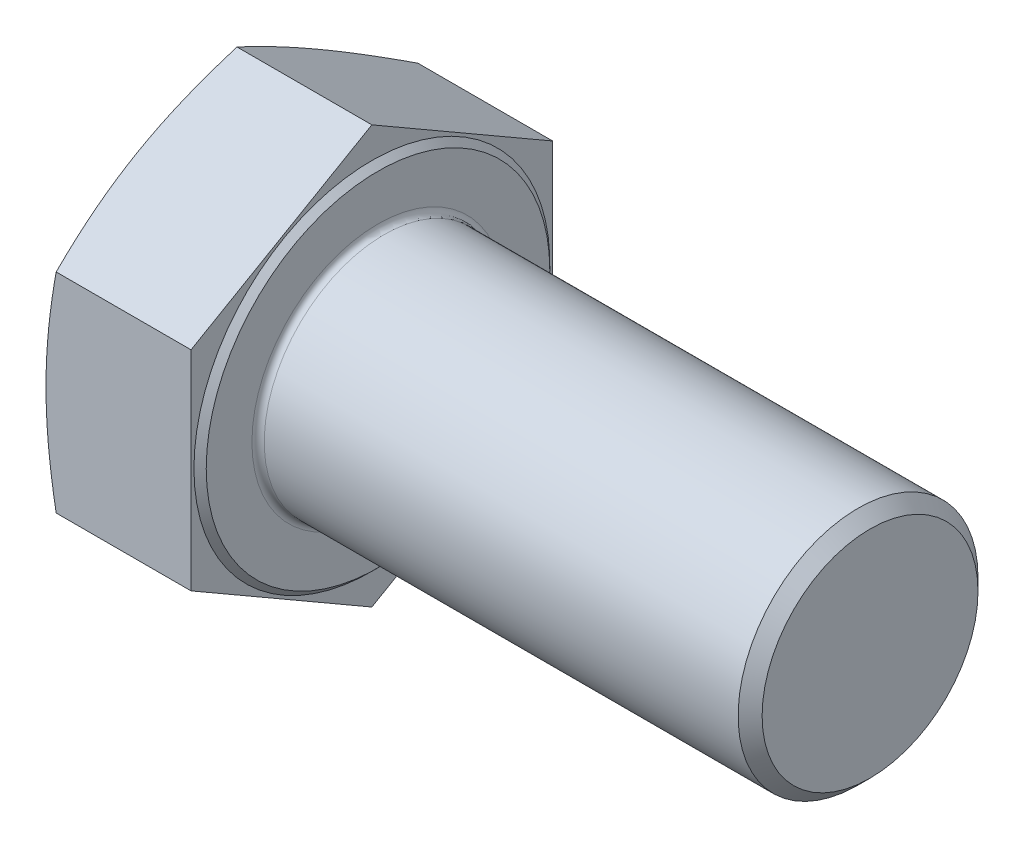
ISO-10303-21;
HEADER;
FILE_DESCRIPTION(('STEP AP214'),'2;1');
FILE_NAME('part.step','',(''),(''),'','','');
FILE_SCHEMA(('AUTOMOTIVE_DESIGN { 1 0 10303 214 1 1 1 1 }'));
ENDSEC;
DATA;
#1=APPLICATION_CONTEXT('core data for automotive mechanical design processes');
#2=APPLICATION_PROTOCOL_DEFINITION('international standard','automotive_design',2000,#1);
#3=PRODUCT_CONTEXT('',#1,'mechanical');
#4=PRODUCT('Part','Part','',(#3));
#5=PRODUCT_RELATED_PRODUCT_CATEGORY('part','',(#4));
#6=PRODUCT_DEFINITION_FORMATION('','',#4);
#7=PRODUCT_DEFINITION_CONTEXT('part definition',#1,'design');
#8=PRODUCT_DEFINITION('design','',#6,#7);
#9=PRODUCT_DEFINITION_SHAPE('','',#8);
#10=(LENGTH_UNIT() NAMED_UNIT(*) SI_UNIT(.MILLI.,.METRE.));
#11=(NAMED_UNIT(*) PLANE_ANGLE_UNIT() SI_UNIT($,.RADIAN.));
#12=(NAMED_UNIT(*) SI_UNIT($,.STERADIAN.) SOLID_ANGLE_UNIT());
#13=UNCERTAINTY_MEASURE_WITH_UNIT(LENGTH_MEASURE(1.E-05),#10,'distance_accuracy_value','');
#14=(GEOMETRIC_REPRESENTATION_CONTEXT(3) GLOBAL_UNCERTAINTY_ASSIGNED_CONTEXT((#13)) GLOBAL_UNIT_ASSIGNED_CONTEXT((#10,
#11,#12)) REPRESENTATION_CONTEXT('',''));
#15=CARTESIAN_POINT('',(0.,0.,0.));
#16=DIRECTION('',(0.,0.,1.));
#17=DIRECTION('',(1.,0.,0.));
#18=AXIS2_PLACEMENT_3D('',#15,#16,#17);
#19=CARTESIAN_POINT('',(24.58,-16.974097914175,-29.4));
#20=DIRECTION('',(1.,0.,0.));
#21=DIRECTION('',(0.,0.,-1.));
#22=AXIS2_PLACEMENT_3D('',#19,#20,#21);
#23=PLANE('',#22);
#24=CARTESIAN_POINT('',(24.58,0.,0.));
#25=DIRECTION('',(1.,0.,0.));
#26=DIRECTION('',(0.,0.,-1.));
#27=AXIS2_PLACEMENT_3D('',#24,#25,#26);
#28=CIRCLE('',#27,20.5);
#29=CARTESIAN_POINT('',(24.58,0.,-20.5));
#30=VERTEX_POINT('',#29);
#31=EDGE_CURVE('E11',#30,#30,#28,.F.);
#32=ORIENTED_EDGE('',*,*,#31,.T.);
#33=EDGE_LOOP('',(#32));
#34=FACE_BOUND('',#33,.T.);
#35=CARTESIAN_POINT('',(24.58,0.,0.));
#36=DIRECTION('',(-1.,0.,0.));
#37=DIRECTION('',(0.,0.,1.));
#38=AXIS2_PLACEMENT_3D('',#35,#36,#37);
#39=CIRCLE('',#38,27.93);
#40=CARTESIAN_POINT('',(24.58,0.,27.93));
#41=VERTEX_POINT('',#40);
#42=EDGE_CURVE('E422',#41,#41,#39,.T.);
#43=ORIENTED_EDGE('',*,*,#42,.F.);
#44=EDGE_LOOP('',(#43));
#45=FACE_BOUND('',#44,.T.);
#46=ADVANCED_FACE('F34',(#34,#45),#23,.T.);
#47=CARTESIAN_POINT('',(24.58,-33.94819582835,0.));
#48=DIRECTION('',(0.,0.866025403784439,0.5));
#49=DIRECTION('',(0.,-0.5,0.866025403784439));
#50=AXIS2_PLACEMENT_3D('',#47,#48,#49);
#51=PLANE('',#50);
#52=CARTESIAN_POINT('',(1.65544992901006,-16.9739824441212,-29.4002));
#53=CARTESIAN_POINT('',(1.5275139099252,-17.3254905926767,-28.7913700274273));
#54=CARTESIAN_POINT('',(1.40533534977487,-17.6775350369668,-28.1816111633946));
#55=CARTESIAN_POINT('',(1.17375096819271,-18.3827051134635,-26.9602207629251));
#56=CARTESIAN_POINT('',(1.06434636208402,-18.7358308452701,-26.3485890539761));
#57=CARTESIAN_POINT('',(0.859514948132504,-19.4433731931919,-25.1230897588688));
#58=CARTESIAN_POINT('',(0.764098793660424,-19.7977905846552,-24.5092208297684));
#59=CARTESIAN_POINT('',(0.588608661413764,-20.5075718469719,-23.2798436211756));
#60=CARTESIAN_POINT('',(0.508534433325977,-20.8629357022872,-22.6643353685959));
#61=CARTESIAN_POINT('',(0.365585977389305,-21.5711444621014,-21.4376818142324));
#62=CARTESIAN_POINT('',(0.302556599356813,-21.9239814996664,-20.8265501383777));
#63=CARTESIAN_POINT('',(0.193711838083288,-22.6303241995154,-19.6031286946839));
#64=CARTESIAN_POINT('',(0.147896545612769,-22.9838298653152,-18.9908389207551));
#65=CARTESIAN_POINT('',(0.0742768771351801,-23.6911828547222,-17.7656676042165));
#66=CARTESIAN_POINT('',(0.0464659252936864,-24.0450300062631,-17.1527863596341));
#67=CARTESIAN_POINT('',(0.00932751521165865,-24.7529670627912,-15.9266034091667));
#68=CARTESIAN_POINT('',(0.,-25.1070569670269,-15.3133017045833));
#69=CARTESIAN_POINT('',(0.,-25.8152367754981,-14.0866982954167));
#70=CARTESIAN_POINT('',(0.00932751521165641,-26.1693266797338,-13.4733965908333));
#71=CARTESIAN_POINT('',(0.046465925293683,-26.8772637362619,-12.2472136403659));
#72=CARTESIAN_POINT('',(0.0742768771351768,-27.2311108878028,-11.6343323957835));
#73=CARTESIAN_POINT('',(0.147896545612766,-27.9384638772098,-10.4091610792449));
#74=CARTESIAN_POINT('',(0.193711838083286,-28.2919695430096,-9.79687130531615));
#75=CARTESIAN_POINT('',(0.30255659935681,-28.9983122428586,-8.57344986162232));
#76=CARTESIAN_POINT('',(0.3655859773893,-29.3511492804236,-7.96231818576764));
#77=CARTESIAN_POINT('',(0.508534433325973,-30.0593580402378,-6.73566463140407));
#78=CARTESIAN_POINT('',(0.588608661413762,-30.4147218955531,-6.1201563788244));
#79=CARTESIAN_POINT('',(0.764098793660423,-31.1245031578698,-4.89077917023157));
#80=CARTESIAN_POINT('',(0.859514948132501,-31.4789205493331,-4.27691024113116));
#81=CARTESIAN_POINT('',(1.06434636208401,-32.1864628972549,-3.05141094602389));
#82=CARTESIAN_POINT('',(1.1737509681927,-32.5395886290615,-2.43977923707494));
#83=CARTESIAN_POINT('',(1.40533534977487,-33.2447587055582,-1.21838883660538));
#84=CARTESIAN_POINT('',(1.5275139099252,-33.5968031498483,-0.608629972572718));
#85=CARTESIAN_POINT('',(1.65544992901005,-33.9483112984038,0.000200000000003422));
#86=B_SPLINE_CURVE_WITH_KNOTS('',3,(#52,#53,#54,#55,#56,#57,#58,#59,#60,#61,#62,#63,#64,#65,#66,
#67,#68,#69,#70,#71,#72,#73,#74,#75,#76,#77,#78,#79,#80,#81,#82,#83,#84,#85),.UNSPECIFIED.,.F.,
.F.,(4,2,2,2,2,2,2,2,2,2,2,2,2,2,2,2,4),(0.,2.14369982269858,4.28760343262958,6.433131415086,
8.57862438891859,10.7038751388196,12.8291370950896,14.9536223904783,17.0781011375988,
19.2025798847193,21.3270651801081,23.4523271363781,25.5775778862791,27.7230708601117,
29.8685988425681,32.0125024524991,34.1562022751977),.UNSPECIFIED.);
#87=CARTESIAN_POINT('',(1.65540790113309,-16.974097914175,-29.4));
#88=VERTEX_POINT('',#87);
#89=CARTESIAN_POINT('',(0.,-25.4611468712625,-14.7));
#90=VERTEX_POINT('',#89);
#91=EDGE_CURVE('E113',#88,#90,#86,.T.);
#92=ORIENTED_EDGE('',*,*,#91,.F.);
#93=DIRECTION('',(-1.,0.,0.));
#94=VECTOR('',#93,1.);
#95=CARTESIAN_POINT('',(24.58,-16.974097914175,-29.4));
#96=LINE('',#95,#94);
#97=CARTESIAN_POINT('',(23.58,-16.974097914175,-29.4));
#98=VERTEX_POINT('',#97);
#99=EDGE_CURVE('E142',#98,#88,#96,.T.);
#100=ORIENTED_EDGE('',*,*,#99,.F.);
#101=DIRECTION('',(0.,0.5,-0.866025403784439));
#102=VECTOR('',#101,1.);
#103=CARTESIAN_POINT('',(23.58,-33.94819582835,0.));
#104=LINE('',#103,#102);
#105=CARTESIAN_POINT('',(23.58,-33.94819582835,0.));
#106=VERTEX_POINT('',#105);
#107=EDGE_CURVE('E427',#106,#98,#104,.T.);
#108=ORIENTED_EDGE('',*,*,#107,.F.);
#109=DIRECTION('',(-1.,0.,0.));
#110=VECTOR('',#109,1.);
#111=CARTESIAN_POINT('',(24.58,-33.94819582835,0.));
#112=LINE('',#111,#110);
#113=CARTESIAN_POINT('',(1.65540790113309,-33.94819582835,0.));
#114=VERTEX_POINT('',#113);
#115=EDGE_CURVE('E136',#106,#114,#112,.T.);
#116=ORIENTED_EDGE('',*,*,#115,.T.);
#117=EDGE_CURVE('E222',#90,#114,#86,.T.);
#118=ORIENTED_EDGE('',*,*,#117,.F.);
#119=EDGE_LOOP('',(#92,#100,#108,#116,#118));
#120=FACE_BOUND('',#119,.T.);
#121=ADVANCED_FACE('F36',(#120),#51,.F.);
#122=CARTESIAN_POINT('',(24.58,-16.974097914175,-29.4));
#123=DIRECTION('',(0.,0.,1.));
#124=DIRECTION('',(0.,-1.,0.));
#125=AXIS2_PLACEMENT_3D('',#122,#123,#124);
#126=PLANE('',#125);
#127=CARTESIAN_POINT('',(8.84584491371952,-44.9414479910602,-29.4));
#128=CARTESIAN_POINT('',(8.64327840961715,-44.2763764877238,-29.4));
#129=CARTESIAN_POINT('',(8.44193693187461,-43.6109320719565,-29.4));
#130=CARTESIAN_POINT('',(8.04197827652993,-42.2792210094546,-29.4));
#131=CARTESIAN_POINT('',(7.8433611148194,-41.6129543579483,-29.4));
#132=CARTESIAN_POINT('',(7.25198186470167,-39.6127195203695,-29.4));
#133=CARTESIAN_POINT('',(6.86372203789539,-38.2774147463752,-29.4));
#134=CARTESIAN_POINT('',(6.10126336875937,-35.6000928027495,-29.4));
#135=CARTESIAN_POINT('',(5.72709211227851,-34.2580677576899,-29.4));
#136=CARTESIAN_POINT('',(4.99715904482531,-31.5690262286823,-29.4));
#137=CARTESIAN_POINT('',(4.64139690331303,-30.2220098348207,-29.4));
#138=CARTESIAN_POINT('',(3.95709637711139,-27.5387320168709,-29.4));
#139=CARTESIAN_POINT('',(3.62827641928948,-26.2025427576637,-29.4));
#140=CARTESIAN_POINT('',(2.99863098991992,-23.5235161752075,-29.4));
#141=CARTESIAN_POINT('',(2.69780598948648,-22.1806787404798,-29.4));
#142=CARTESIAN_POINT('',(2.13116522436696,-19.4880508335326,-29.4));
#143=CARTESIAN_POINT('',(1.86533751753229,-18.1382628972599,-29.4));
#144=CARTESIAN_POINT('',(1.37678298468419,-15.4308636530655,-29.4));
#145=CARTESIAN_POINT('',(1.15405471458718,-14.0732526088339,-29.4));
#146=CARTESIAN_POINT('',(0.782809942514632,-11.5030206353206,-29.4));
#147=CARTESIAN_POINT('',(0.628772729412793,-10.2912096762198,-29.4));
#148=CARTESIAN_POINT('',(0.433189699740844,-8.46971553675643,-29.4));
#149=CARTESIAN_POINT('',(0.373906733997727,-7.86191013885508,-29.4));
#150=CARTESIAN_POINT('',(0.267832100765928,-6.64521595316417,-29.4));
#151=CARTESIAN_POINT('',(0.221040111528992,-6.03632719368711,-29.4));
#152=CARTESIAN_POINT('',(0.140552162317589,-4.8181027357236,-29.4));
#153=CARTESIAN_POINT('',(0.106847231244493,-4.20876763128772,-29.4));
#154=CARTESIAN_POINT('',(0.0529231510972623,-2.98949852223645,-29.4));
#155=CARTESIAN_POINT('',(0.0327039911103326,-2.3795645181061,-29.4));
#156=CARTESIAN_POINT('',(0.00602332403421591,-1.15939670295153,-29.4));
#157=CARTESIAN_POINT('',(-0.000438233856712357,-0.549162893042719,-29.4));
#158=CARTESIAN_POINT('',(0.000484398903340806,0.671294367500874,-29.4));
#159=CARTESIAN_POINT('',(0.00786859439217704,1.28151781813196,-29.4));
#160=CARTESIAN_POINT('',(0.0364542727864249,2.50473436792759,-29.4));
#161=CARTESIAN_POINT('',(0.0577255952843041,3.11772582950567,-29.4));
#162=CARTESIAN_POINT('',(0.113864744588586,4.34308303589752,-29.4));
#163=CARTESIAN_POINT('',(0.148732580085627,4.95544878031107,-29.4));
#164=CARTESIAN_POINT('',(0.231611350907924,6.17928932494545,-29.4));
#165=CARTESIAN_POINT('',(0.27962230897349,6.79076412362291,-29.4));
#166=CARTESIAN_POINT('',(0.388192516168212,8.01260431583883,-29.4));
#167=CARTESIAN_POINT('',(0.448752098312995,8.62296967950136,-29.4));
#168=CARTESIAN_POINT('',(0.648336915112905,10.4531228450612,-29.4));
#169=CARTESIAN_POINT('',(0.805200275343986,11.6709945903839,-29.4));
#170=CARTESIAN_POINT('',(1.16016895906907,14.1006040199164,-29.4));
#171=CARTESIAN_POINT('',(1.35827450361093,15.3123416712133,-29.4));
#172=CARTESIAN_POINT('',(1.80067196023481,17.7934990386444,-29.4));
#173=CARTESIAN_POINT('',(2.0468526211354,19.0625795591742,-29.4));
#174=CARTESIAN_POINT('',(2.57089937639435,21.594220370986,-29.4));
#175=CARTESIAN_POINT('',(2.84876785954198,22.856780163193,-29.4));
#176=CARTESIAN_POINT('',(3.4303549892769,25.3762832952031,-29.4));
#177=CARTESIAN_POINT('',(3.73408114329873,26.6332248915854,-29.4));
#178=CARTESIAN_POINT('',(4.36244304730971,29.1418129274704,-29.4));
#179=CARTESIAN_POINT('',(4.68707829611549,30.3934594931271,-29.4));
#180=CARTESIAN_POINT('',(5.35377779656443,32.8938074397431,-29.4));
#181=CARTESIAN_POINT('',(5.69586389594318,34.1425029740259,-29.4));
#182=CARTESIAN_POINT('',(6.39395180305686,36.6359928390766,-29.4));
#183=CARTESIAN_POINT('',(6.74995366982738,37.88078715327,-29.4));
#184=CARTESIAN_POINT('',(7.47332607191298,40.3668343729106,-29.4));
#185=CARTESIAN_POINT('',(7.84069468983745,41.6080878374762,-29.4));
#186=CARTESIAN_POINT('',(8.58488250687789,44.0877508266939,-29.4));
#187=CARTESIAN_POINT('',(8.96170168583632,45.3261603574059,-29.4));
#188=CARTESIAN_POINT('',(9.71901271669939,47.7868927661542,-29.4));
#189=CARTESIAN_POINT('',(10.0994180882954,49.009242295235,-29.4));
#190=CARTESIAN_POINT('',(10.8667087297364,51.4519039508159,-29.4));
#191=CARTESIAN_POINT('',(11.2535940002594,52.6722160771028,-29.4));
#192=CARTESIAN_POINT('',(12.032871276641,55.1111409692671,-29.4));
#193=CARTESIAN_POINT('',(12.4252635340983,56.3297536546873,-29.4));
#194=CARTESIAN_POINT('',(13.2147302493,58.7654616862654,-29.4));
#195=CARTESIAN_POINT('',(13.6118047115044,59.9825570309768,-29.4));
#196=CARTESIAN_POINT('',(14.4084575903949,62.4108110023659,-29.4));
#197=CARTESIAN_POINT('',(14.8080207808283,63.6219746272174,-29.4));
#198=CARTESIAN_POINT('',(15.610595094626,66.0431592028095,-29.4));
#199=CARTESIAN_POINT('',(16.013606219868,67.2531801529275,-29.4));
#200=CARTESIAN_POINT('',(16.8225888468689,69.6721214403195,-29.4));
#201=CARTESIAN_POINT('',(17.2285601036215,70.8810418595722,-29.4));
#202=CARTESIAN_POINT('',(18.0431295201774,73.2979942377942,-29.4));
#203=CARTESIAN_POINT('',(18.4517276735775,74.506026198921,-29.4));
#204=CARTESIAN_POINT('',(18.8614572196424,75.7136733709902,-29.4));
#205=B_SPLINE_CURVE_WITH_KNOTS('',3,(#127,#128,#129,#130,#131,#132,#133,#134,#135,#136,#137,
#138,#139,#140,#141,#142,#143,#144,#145,#146,#147,#148,#149,#150,#151,#152,#153,#154,#155,#156,
#157,#158,#159,#160,#161,#162,#163,#164,#165,#166,#167,#168,#169,#170,#171,#172,#173,#174,#175,
#176,#177,#178,#179,#180,#181,#182,#183,#184,#185,#186,#187,#188,#189,#190,#191,#192,#193,#194,
#195,#196,#197,#198,#199,#200,#201,#202,#203,#204),.UNSPECIFIED.,.F.,.F.,(4,2,2,2,2,2,2,2,2,2,2,
2,2,2,2,2,2,2,2,2,2,2,2,2,2,2,2,2,2,2,2,2,2,2,2,2,2,2,4),(0.,2.08570621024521,4.17142458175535,
8.34316965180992,12.5226981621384,16.7021516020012,20.8300745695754,24.9580669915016,
29.0846471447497,33.2110890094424,36.8748774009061,38.7068381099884,40.5387516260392,
42.3694071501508,44.2000611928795,46.0307084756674,47.8613563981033,49.7012824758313,
51.5412097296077,53.3811401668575,55.2211194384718,58.9040023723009,62.5869050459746,
66.4646143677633,70.3426162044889,74.2217478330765,78.1007865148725,81.9848068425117,
85.8688436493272,89.752228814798,93.6356056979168,97.4761079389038,101.316610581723,
105.157289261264,108.997971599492,112.824075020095,116.650180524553,120.475972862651,
124.301755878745),.UNSPECIFIED.);
#206=CARTESIAN_POINT('',(1.65540790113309,16.974097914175,-29.4));
#207=VERTEX_POINT('',#206);
#208=CARTESIAN_POINT('',(0.,0.,-29.4));
#209=VERTEX_POINT('',#208);
#210=EDGE_CURVE('E233',#207,#209,#205,.F.);
#211=ORIENTED_EDGE('',*,*,#210,.F.);
#212=DIRECTION('',(-1.,0.,0.));
#213=VECTOR('',#212,1.);
#214=CARTESIAN_POINT('',(24.58,16.974097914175,-29.4));
#215=LINE('',#214,#213);
#216=CARTESIAN_POINT('',(23.58,16.974097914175,-29.4));
#217=VERTEX_POINT('',#216);
#218=EDGE_CURVE('E133',#217,#207,#215,.T.);
#219=ORIENTED_EDGE('',*,*,#218,.F.);
#220=DIRECTION('',(0.,1.,0.));
#221=VECTOR('',#220,1.);
#222=CARTESIAN_POINT('',(23.58,-16.974097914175,-29.4));
#223=LINE('',#222,#221);
#224=EDGE_CURVE('E420',#98,#217,#223,.T.);
#225=ORIENTED_EDGE('',*,*,#224,.F.);
#226=ORIENTED_EDGE('',*,*,#99,.T.);
#227=EDGE_CURVE('E124',#209,#88,#205,.F.);
#228=ORIENTED_EDGE('',*,*,#227,.F.);
#229=EDGE_LOOP('',(#211,#219,#225,#226,#228));
#230=FACE_BOUND('',#229,.T.);
#231=ADVANCED_FACE('F181',(#230),#126,.F.);
#232=CARTESIAN_POINT('',(24.58,16.974097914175,-29.4));
#233=DIRECTION('',(0.,-0.866025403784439,0.5));
#234=DIRECTION('',(0.,-0.5,-0.866025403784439));
#235=AXIS2_PLACEMENT_3D('',#232,#233,#234);
#236=PLANE('',#235);
#237=CARTESIAN_POINT('',(1.65544992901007,33.9483112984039,0.000199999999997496));
#238=CARTESIAN_POINT('',(1.52751390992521,33.5968031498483,-0.60862997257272));
#239=CARTESIAN_POINT('',(1.40533534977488,33.2447587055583,-1.21838883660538));
#240=CARTESIAN_POINT('',(1.17375096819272,32.5395886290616,-2.43977923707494));
#241=CARTESIAN_POINT('',(1.06434636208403,32.186462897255,-3.0514109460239));
#242=CARTESIAN_POINT('',(0.859514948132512,31.4789205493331,-4.27691024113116));
#243=CARTESIAN_POINT('',(0.764098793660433,31.1245031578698,-4.89077917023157));
#244=CARTESIAN_POINT('',(0.588608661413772,30.4147218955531,-6.12015637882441));
#245=CARTESIAN_POINT('',(0.508534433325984,30.0593580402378,-6.73566463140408));
#246=CARTESIAN_POINT('',(0.365585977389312,29.3511492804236,-7.96231818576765));
#247=CARTESIAN_POINT('',(0.302556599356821,28.9983122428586,-8.57344986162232));
#248=CARTESIAN_POINT('',(0.193711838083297,28.2919695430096,-9.79687130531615));
#249=CARTESIAN_POINT('',(0.147896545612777,27.9384638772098,-10.4091610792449));
#250=CARTESIAN_POINT('',(0.0742768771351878,27.2311108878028,-11.6343323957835));
#251=CARTESIAN_POINT('',(0.0464659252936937,26.8772637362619,-12.2472136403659));
#252=CARTESIAN_POINT('',(0.00932751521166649,26.1693266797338,-13.4733965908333));
#253=CARTESIAN_POINT('',(0.,25.8152367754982,-14.0866982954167));
#254=CARTESIAN_POINT('',(0.,25.1070569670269,-15.3133017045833));
#255=CARTESIAN_POINT('',(0.00932751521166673,24.7529670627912,-15.9266034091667));
#256=CARTESIAN_POINT('',(0.0464659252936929,24.0450300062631,-17.1527863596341));
#257=CARTESIAN_POINT('',(0.0742768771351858,23.6911828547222,-17.7656676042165));
#258=CARTESIAN_POINT('',(0.147896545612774,22.9838298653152,-18.9908389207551));
#259=CARTESIAN_POINT('',(0.193711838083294,22.6303241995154,-19.6031286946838));
#260=CARTESIAN_POINT('',(0.302556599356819,21.9239814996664,-20.8265501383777));
#261=CARTESIAN_POINT('',(0.36558597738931,21.5711444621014,-21.4376818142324));
#262=CARTESIAN_POINT('',(0.508534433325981,20.8629357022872,-22.6643353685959));
#263=CARTESIAN_POINT('',(0.588608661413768,20.5075718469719,-23.2798436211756));
#264=CARTESIAN_POINT('',(0.764098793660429,19.7977905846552,-24.5092208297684));
#265=CARTESIAN_POINT('',(0.859514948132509,19.443373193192,-25.1230897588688));
#266=CARTESIAN_POINT('',(1.06434636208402,18.7358308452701,-26.3485890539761));
#267=CARTESIAN_POINT('',(1.17375096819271,18.3827051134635,-26.9602207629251));
#268=CARTESIAN_POINT('',(1.40533534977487,17.6775350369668,-28.1816111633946));
#269=CARTESIAN_POINT('',(1.5275139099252,17.3254905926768,-28.7913700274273));
#270=CARTESIAN_POINT('',(1.65544992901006,16.9739824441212,-29.4002));
#271=B_SPLINE_CURVE_WITH_KNOTS('',3,(#237,#238,#239,#240,#241,#242,#243,#244,#245,#246,#247,
#248,#249,#250,#251,#252,#253,#254,#255,#256,#257,#258,#259,#260,#261,#262,#263,#264,#265,#266,
#267,#268,#269,#270),.UNSPECIFIED.,.F.,.F.,(4,2,2,2,2,2,2,2,2,2,2,2,2,2,2,2,4),(0.,
2.14369982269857,4.28760343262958,6.433131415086,8.57862438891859,10.7038751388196,
12.8291370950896,14.9536223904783,17.0781011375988,19.2025798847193,21.3270651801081,
23.4523271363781,25.5775778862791,27.7230708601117,29.8685988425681,32.0125024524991,
34.1562022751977),.UNSPECIFIED.);
#272=CARTESIAN_POINT('',(1.65540790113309,33.94819582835,0.));
#273=VERTEX_POINT('',#272);
#274=CARTESIAN_POINT('',(0.,25.4611468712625,-14.7));
#275=VERTEX_POINT('',#274);
#276=EDGE_CURVE('E50',#273,#275,#271,.T.);
#277=ORIENTED_EDGE('',*,*,#276,.F.);
#278=DIRECTION('',(-1.,0.,0.));
#279=VECTOR('',#278,1.);
#280=CARTESIAN_POINT('',(24.58,33.94819582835,0.));
#281=LINE('',#280,#279);
#282=CARTESIAN_POINT('',(23.58,33.94819582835,0.));
#283=VERTEX_POINT('',#282);
#284=EDGE_CURVE('E130',#283,#273,#281,.T.);
#285=ORIENTED_EDGE('',*,*,#284,.F.);
#286=DIRECTION('',(0.,0.5,0.866025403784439));
#287=VECTOR('',#286,1.);
#288=CARTESIAN_POINT('',(23.58,16.974097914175,-29.4));
#289=LINE('',#288,#287);
#290=EDGE_CURVE('E418',#217,#283,#289,.T.);
#291=ORIENTED_EDGE('',*,*,#290,.F.);
#292=ORIENTED_EDGE('',*,*,#218,.T.);
#293=EDGE_CURVE('E234',#275,#207,#271,.T.);
#294=ORIENTED_EDGE('',*,*,#293,.F.);
#295=EDGE_LOOP('',(#277,#285,#291,#292,#294));
#296=FACE_BOUND('',#295,.T.);
#297=ADVANCED_FACE('F242',(#296),#236,.F.);
#298=CARTESIAN_POINT('',(24.58,33.94819582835,0.));
#299=DIRECTION('',(0.,-0.866025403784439,-0.5));
#300=DIRECTION('',(0.,0.5,-0.866025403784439));
#301=AXIS2_PLACEMENT_3D('',#298,#299,#300);
#302=PLANE('',#301);
#303=CARTESIAN_POINT('',(1.65544992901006,16.9739824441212,29.4002));
#304=CARTESIAN_POINT('',(1.52751390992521,17.3254905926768,28.7913700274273));
#305=CARTESIAN_POINT('',(1.40533534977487,17.6775350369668,28.1816111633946));
#306=CARTESIAN_POINT('',(1.17375096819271,18.3827051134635,26.9602207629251));
#307=CARTESIAN_POINT('',(1.06434636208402,18.7358308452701,26.3485890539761));
#308=CARTESIAN_POINT('',(0.859514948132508,19.443373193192,25.1230897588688));
#309=CARTESIAN_POINT('',(0.764098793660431,19.7977905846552,24.5092208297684));
#310=CARTESIAN_POINT('',(0.588608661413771,20.5075718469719,23.2798436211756));
#311=CARTESIAN_POINT('',(0.508534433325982,20.8629357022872,22.6643353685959));
#312=CARTESIAN_POINT('',(0.365585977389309,21.5711444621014,21.4376818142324));
#313=CARTESIAN_POINT('',(0.302556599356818,21.9239814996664,20.8265501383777));
#314=CARTESIAN_POINT('',(0.193711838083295,22.6303241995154,19.6031286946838));
#315=CARTESIAN_POINT('',(0.147896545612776,22.9838298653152,18.9908389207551));
#316=CARTESIAN_POINT('',(0.0742768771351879,23.6911828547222,17.7656676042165));
#317=CARTESIAN_POINT('',(0.0464659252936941,24.0450300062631,17.1527863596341));
#318=CARTESIAN_POINT('',(0.00932751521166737,24.7529670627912,15.9266034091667));
#319=CARTESIAN_POINT('',(0.,25.1070569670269,15.3133017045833));
#320=CARTESIAN_POINT('',(0.,25.8152367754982,14.0866982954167));
#321=CARTESIAN_POINT('',(0.00932751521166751,26.1693266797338,13.4733965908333));
#322=CARTESIAN_POINT('',(0.046465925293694,26.8772637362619,12.2472136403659));
#323=CARTESIAN_POINT('',(0.0742768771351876,27.2311108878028,11.6343323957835));
#324=CARTESIAN_POINT('',(0.147896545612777,27.9384638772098,10.4091610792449));
#325=CARTESIAN_POINT('',(0.193711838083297,28.2919695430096,9.79687130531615));
#326=CARTESIAN_POINT('',(0.302556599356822,28.9983122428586,8.57344986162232));
#327=CARTESIAN_POINT('',(0.365585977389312,29.3511492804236,7.96231818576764));
#328=CARTESIAN_POINT('',(0.508534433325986,30.0593580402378,6.73566463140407));
#329=CARTESIAN_POINT('',(0.588608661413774,30.4147218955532,6.1201563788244));
#330=CARTESIAN_POINT('',(0.764098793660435,31.1245031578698,4.89077917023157));
#331=CARTESIAN_POINT('',(0.859514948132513,31.4789205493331,4.27691024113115));
#332=CARTESIAN_POINT('',(1.06434636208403,32.186462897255,3.05141094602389));
#333=CARTESIAN_POINT('',(1.17375096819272,32.5395886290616,2.43977923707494));
#334=CARTESIAN_POINT('',(1.40533534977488,33.2447587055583,1.21838883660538));
#335=CARTESIAN_POINT('',(1.52751390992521,33.5968031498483,0.608629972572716));
#336=CARTESIAN_POINT('',(1.65544992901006,33.9483112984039,-0.000200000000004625));
#337=B_SPLINE_CURVE_WITH_KNOTS('',3,(#303,#304,#305,#306,#307,#308,#309,#310,#311,#312,#313,
#314,#315,#316,#317,#318,#319,#320,#321,#322,#323,#324,#325,#326,#327,#328,#329,#330,#331,#332,
#333,#334,#335,#336),.UNSPECIFIED.,.F.,.F.,(4,2,2,2,2,2,2,2,2,2,2,2,2,2,2,2,4),(0.,
2.14369982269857,4.28760343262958,6.433131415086,8.57862438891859,10.7038751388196,
12.8291370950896,14.9536223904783,17.0781011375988,19.2025798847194,21.3270651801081,
23.4523271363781,25.5775778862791,27.7230708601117,29.8685988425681,32.0125024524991,
34.1562022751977),.UNSPECIFIED.);
#338=CARTESIAN_POINT('',(1.65540790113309,16.9740979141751,29.4));
#339=VERTEX_POINT('',#338);
#340=CARTESIAN_POINT('',(0.,25.4611468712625,14.7));
#341=VERTEX_POINT('',#340);
#342=EDGE_CURVE('E58',#339,#341,#337,.T.);
#343=ORIENTED_EDGE('',*,*,#342,.F.);
#344=DIRECTION('',(-1.,0.,0.));
#345=VECTOR('',#344,1.);
#346=CARTESIAN_POINT('',(24.58,16.974097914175,29.4));
#347=LINE('',#346,#345);
#348=CARTESIAN_POINT('',(23.58,16.9740979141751,29.4));
#349=VERTEX_POINT('',#348);
#350=EDGE_CURVE('E121',#349,#339,#347,.T.);
#351=ORIENTED_EDGE('',*,*,#350,.F.);
#352=DIRECTION('',(0.,-0.5,0.866025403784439));
#353=VECTOR('',#352,1.);
#354=CARTESIAN_POINT('',(23.58,33.94819582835,0.));
#355=LINE('',#354,#353);
#356=EDGE_CURVE('E416',#283,#349,#355,.T.);
#357=ORIENTED_EDGE('',*,*,#356,.F.);
#358=ORIENTED_EDGE('',*,*,#284,.T.);
#359=EDGE_CURVE('E123',#341,#273,#337,.T.);
#360=ORIENTED_EDGE('',*,*,#359,.F.);
#361=EDGE_LOOP('',(#343,#351,#357,#358,#360));
#362=FACE_BOUND('',#361,.T.);
#363=ADVANCED_FACE('F119',(#362),#302,.F.);
#364=CARTESIAN_POINT('',(24.58,16.974097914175,29.4));
#365=DIRECTION('',(0.,0.,-1.));
#366=DIRECTION('',(0.,1.,0.));
#367=AXIS2_PLACEMENT_3D('',#364,#365,#366);
#368=PLANE('',#367);
#369=CARTESIAN_POINT('',(8.84584491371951,-44.9414479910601,29.4));
#370=CARTESIAN_POINT('',(8.64327840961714,-44.2763764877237,29.4));
#371=CARTESIAN_POINT('',(8.4419369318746,-43.6109320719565,29.4));
#372=CARTESIAN_POINT('',(8.04197827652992,-42.2792210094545,29.4));
#373=CARTESIAN_POINT('',(7.84336111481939,-41.6129543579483,29.4));
#374=CARTESIAN_POINT('',(7.25198186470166,-39.6127195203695,29.4));
#375=CARTESIAN_POINT('',(6.86372203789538,-38.2774147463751,29.4));
#376=CARTESIAN_POINT('',(6.10126336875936,-35.6000928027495,29.4));
#377=CARTESIAN_POINT('',(5.7270921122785,-34.2580677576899,29.4));
#378=CARTESIAN_POINT('',(4.9971590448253,-31.5690262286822,29.4));
#379=CARTESIAN_POINT('',(4.64139690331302,-30.2220098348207,29.4));
#380=CARTESIAN_POINT('',(3.95709637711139,-27.5387320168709,29.4));
#381=CARTESIAN_POINT('',(3.62827641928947,-26.2025427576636,29.4));
#382=CARTESIAN_POINT('',(2.99863098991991,-23.5235161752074,29.4));
#383=CARTESIAN_POINT('',(2.69780598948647,-22.1806787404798,29.4));
#384=CARTESIAN_POINT('',(2.13116522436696,-19.4880508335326,29.4));
#385=CARTESIAN_POINT('',(1.86533751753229,-18.1382628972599,29.4));
#386=CARTESIAN_POINT('',(1.37678298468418,-15.4308636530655,29.4));
#387=CARTESIAN_POINT('',(1.15405471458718,-14.0732526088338,29.4));
#388=CARTESIAN_POINT('',(0.782809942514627,-11.5030206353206,29.4));
#389=CARTESIAN_POINT('',(0.62877272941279,-10.2912096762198,29.4));
#390=CARTESIAN_POINT('',(0.43318969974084,-8.4697155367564,29.4));
#391=CARTESIAN_POINT('',(0.373906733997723,-7.86191013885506,29.4));
#392=CARTESIAN_POINT('',(0.267832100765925,-6.64521595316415,29.4));
#393=CARTESIAN_POINT('',(0.221040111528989,-6.03632719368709,29.4));
#394=CARTESIAN_POINT('',(0.140552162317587,-4.81810273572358,29.4));
#395=CARTESIAN_POINT('',(0.106847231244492,-4.2087676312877,29.4));
#396=CARTESIAN_POINT('',(0.0529231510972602,-2.98949852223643,29.4));
#397=CARTESIAN_POINT('',(0.0327039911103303,-2.37956451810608,29.4));
#398=CARTESIAN_POINT('',(0.00602332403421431,-1.15939670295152,29.4));
#399=CARTESIAN_POINT('',(-0.000438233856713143,-0.549162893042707,29.4));
#400=CARTESIAN_POINT('',(0.000484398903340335,0.671294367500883,29.4));
#401=CARTESIAN_POINT('',(0.00786859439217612,1.28151781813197,29.4));
#402=CARTESIAN_POINT('',(0.0364542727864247,2.50473436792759,29.4));
#403=CARTESIAN_POINT('',(0.0577255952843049,3.11772582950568,29.4));
#404=CARTESIAN_POINT('',(0.113864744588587,4.34308303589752,29.4));
#405=CARTESIAN_POINT('',(0.148732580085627,4.95544878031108,29.4));
#406=CARTESIAN_POINT('',(0.231611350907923,6.17928932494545,29.4));
#407=CARTESIAN_POINT('',(0.279622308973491,6.79076412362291,29.4));
#408=CARTESIAN_POINT('',(0.388192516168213,8.01260431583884,29.4));
#409=CARTESIAN_POINT('',(0.448752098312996,8.62296967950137,29.4));
#410=CARTESIAN_POINT('',(0.648336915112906,10.4531228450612,29.4));
#411=CARTESIAN_POINT('',(0.805200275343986,11.6709945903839,29.4));
#412=CARTESIAN_POINT('',(1.16016895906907,14.1006040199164,29.4));
#413=CARTESIAN_POINT('',(1.35827450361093,15.3123416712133,29.4));
#414=CARTESIAN_POINT('',(1.80067196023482,17.7934990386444,29.4));
#415=CARTESIAN_POINT('',(2.0468526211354,19.0625795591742,29.4));
#416=CARTESIAN_POINT('',(2.57089937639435,21.594220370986,29.4));
#417=CARTESIAN_POINT('',(2.84876785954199,22.856780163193,29.4));
#418=CARTESIAN_POINT('',(3.43035498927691,25.3762832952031,29.4));
#419=CARTESIAN_POINT('',(3.73408114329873,26.6332248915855,29.4));
#420=CARTESIAN_POINT('',(4.36244304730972,29.1418129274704,29.4));
#421=CARTESIAN_POINT('',(4.6870782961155,30.3934594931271,29.4));
#422=CARTESIAN_POINT('',(5.35377779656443,32.8938074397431,29.4));
#423=CARTESIAN_POINT('',(5.69586389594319,34.1425029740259,29.4));
#424=CARTESIAN_POINT('',(6.39395180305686,36.6359928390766,29.4));
#425=CARTESIAN_POINT('',(6.74995366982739,37.8807871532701,29.4));
#426=CARTESIAN_POINT('',(7.47332607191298,40.3668343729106,29.4));
#427=CARTESIAN_POINT('',(7.84069468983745,41.6080878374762,29.4));
#428=CARTESIAN_POINT('',(8.5848825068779,44.0877508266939,29.4));
#429=CARTESIAN_POINT('',(8.96170168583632,45.3261603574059,29.4));
#430=CARTESIAN_POINT('',(9.71901271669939,47.7868927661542,29.4));
#431=CARTESIAN_POINT('',(10.0994180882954,49.009242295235,29.4));
#432=CARTESIAN_POINT('',(10.8667087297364,51.451903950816,29.4));
#433=CARTESIAN_POINT('',(11.2535940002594,52.6722160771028,29.4));
#434=CARTESIAN_POINT('',(12.032871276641,55.1111409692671,29.4));
#435=CARTESIAN_POINT('',(12.4252635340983,56.3297536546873,29.4));
#436=CARTESIAN_POINT('',(13.2147302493,58.7654616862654,29.4));
#437=CARTESIAN_POINT('',(13.6118047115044,59.9825570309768,29.4));
#438=CARTESIAN_POINT('',(14.4084575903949,62.4108110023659,29.4));
#439=CARTESIAN_POINT('',(14.8080207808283,63.6219746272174,29.4));
#440=CARTESIAN_POINT('',(15.610595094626,66.0431592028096,29.4));
#441=CARTESIAN_POINT('',(16.013606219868,67.2531801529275,29.4));
#442=CARTESIAN_POINT('',(16.8225888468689,69.6721214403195,29.4));
#443=CARTESIAN_POINT('',(17.2285601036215,70.8810418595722,29.4));
#444=CARTESIAN_POINT('',(18.0431295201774,73.2979942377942,29.4));
#445=CARTESIAN_POINT('',(18.4517276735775,74.506026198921,29.4));
#446=CARTESIAN_POINT('',(18.8614572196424,75.7136733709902,29.4));
#447=B_SPLINE_CURVE_WITH_KNOTS('',3,(#369,#370,#371,#372,#373,#374,#375,#376,#377,#378,#379,
#380,#381,#382,#383,#384,#385,#386,#387,#388,#389,#390,#391,#392,#393,#394,#395,#396,#397,#398,
#399,#400,#401,#402,#403,#404,#405,#406,#407,#408,#409,#410,#411,#412,#413,#414,#415,#416,#417,
#418,#419,#420,#421,#422,#423,#424,#425,#426,#427,#428,#429,#430,#431,#432,#433,#434,#435,#436,
#437,#438,#439,#440,#441,#442,#443,#444,#445,#446),.UNSPECIFIED.,.F.,.F.,(4,2,2,2,2,2,2,2,2,2,2,
2,2,2,2,2,2,2,2,2,2,2,2,2,2,2,2,2,2,2,2,2,2,2,2,2,2,2,4),(0.,2.08570621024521,4.17142458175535,
8.34316965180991,12.5226981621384,16.7021516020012,20.8300745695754,24.9580669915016,
29.0846471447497,33.2110890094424,36.874877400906,38.7068381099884,40.5387516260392,
42.3694071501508,44.2000611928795,46.0307084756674,47.8613563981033,49.7012824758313,
51.5412097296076,53.3811401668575,55.2211194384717,58.9040023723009,62.5869050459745,
66.4646143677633,70.3426162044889,74.2217478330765,78.1007865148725,81.9848068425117,
85.8688436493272,89.752228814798,93.6356056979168,97.4761079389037,101.316610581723,
105.157289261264,108.997971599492,112.824075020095,116.650180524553,120.475972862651,
124.301755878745),.UNSPECIFIED.);
#448=CARTESIAN_POINT('',(1.65540790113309,-16.974097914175,29.4000000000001));
#449=VERTEX_POINT('',#448);
#450=CARTESIAN_POINT('',(0.,0.,29.4));
#451=VERTEX_POINT('',#450);
#452=EDGE_CURVE('E115',#449,#451,#447,.T.);
#453=ORIENTED_EDGE('',*,*,#452,.F.);
#454=DIRECTION('',(-1.,0.,0.));
#455=VECTOR('',#454,1.);
#456=CARTESIAN_POINT('',(24.58,-16.974097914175,29.4));
#457=LINE('',#456,#455);
#458=CARTESIAN_POINT('',(23.58,-16.974097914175,29.4));
#459=VERTEX_POINT('',#458);
#460=EDGE_CURVE('E131',#459,#449,#457,.T.);
#461=ORIENTED_EDGE('',*,*,#460,.F.);
#462=DIRECTION('',(0.,-1.,0.));
#463=VECTOR('',#462,1.);
#464=CARTESIAN_POINT('',(23.58,16.974097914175,29.4));
#465=LINE('',#464,#463);
#466=EDGE_CURVE('E129',#349,#459,#465,.T.);
#467=ORIENTED_EDGE('',*,*,#466,.F.);
#468=ORIENTED_EDGE('',*,*,#350,.T.);
#469=EDGE_CURVE('E105',#451,#339,#447,.T.);
#470=ORIENTED_EDGE('',*,*,#469,.F.);
#471=EDGE_LOOP('',(#453,#461,#467,#468,#470));
#472=FACE_BOUND('',#471,.T.);
#473=ADVANCED_FACE('F127',(#472),#368,.F.);
#474=CARTESIAN_POINT('',(24.58,-16.974097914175,29.4));
#475=DIRECTION('',(0.,0.866025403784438,-0.5));
#476=DIRECTION('',(0.,0.5,0.866025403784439));
#477=AXIS2_PLACEMENT_3D('',#474,#475,#476);
#478=PLANE('',#477);
#479=CARTESIAN_POINT('',(1.65544992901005,-33.9483112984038,-0.000199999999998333));
#480=CARTESIAN_POINT('',(1.5275139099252,-33.5968031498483,0.608629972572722));
#481=CARTESIAN_POINT('',(1.40533534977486,-33.2447587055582,1.21838883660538));
#482=CARTESIAN_POINT('',(1.1737509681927,-32.5395886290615,2.43977923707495));
#483=CARTESIAN_POINT('',(1.06434636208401,-32.1864628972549,3.0514109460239));
#484=CARTESIAN_POINT('',(0.859514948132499,-31.4789205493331,4.27691024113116));
#485=CARTESIAN_POINT('',(0.764098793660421,-31.1245031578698,4.89077917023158));
#486=CARTESIAN_POINT('',(0.588608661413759,-30.4147218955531,6.12015637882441));
#487=CARTESIAN_POINT('',(0.50853443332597,-30.0593580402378,6.73566463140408));
#488=CARTESIAN_POINT('',(0.365585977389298,-29.3511492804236,7.96231818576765));
#489=CARTESIAN_POINT('',(0.302556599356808,-28.9983122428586,8.57344986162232));
#490=CARTESIAN_POINT('',(0.193711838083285,-28.2919695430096,9.79687130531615));
#491=CARTESIAN_POINT('',(0.147896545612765,-27.9384638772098,10.4091610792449));
#492=CARTESIAN_POINT('',(0.0742768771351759,-27.2311108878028,11.6343323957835));
#493=CARTESIAN_POINT('',(0.0464659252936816,-26.8772637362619,12.2472136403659));
#494=CARTESIAN_POINT('',(0.00932751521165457,-26.1693266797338,13.4733965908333));
#495=CARTESIAN_POINT('',(0.,-25.8152367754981,14.0866982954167));
#496=CARTESIAN_POINT('',(0.,-25.1070569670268,15.3133017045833));
#497=CARTESIAN_POINT('',(0.00932751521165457,-24.7529670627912,15.9266034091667));
#498=CARTESIAN_POINT('',(0.0464659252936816,-24.0450300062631,17.1527863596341));
#499=CARTESIAN_POINT('',(0.0742768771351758,-23.6911828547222,17.7656676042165));
#500=CARTESIAN_POINT('',(0.147896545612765,-22.9838298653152,18.9908389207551));
#501=CARTESIAN_POINT('',(0.193711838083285,-22.6303241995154,19.6031286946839));
#502=CARTESIAN_POINT('',(0.302556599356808,-21.9239814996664,20.8265501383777));
#503=CARTESIAN_POINT('',(0.365585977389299,-21.5711444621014,21.4376818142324));
#504=CARTESIAN_POINT('',(0.508534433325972,-20.8629357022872,22.6643353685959));
#505=CARTESIAN_POINT('',(0.588608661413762,-20.5075718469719,23.2798436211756));
#506=CARTESIAN_POINT('',(0.764098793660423,-19.7977905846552,24.5092208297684));
#507=CARTESIAN_POINT('',(0.8595149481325,-19.4433731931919,25.1230897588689));
#508=CARTESIAN_POINT('',(1.06434636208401,-18.7358308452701,26.3485890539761));
#509=CARTESIAN_POINT('',(1.1737509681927,-18.3827051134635,26.9602207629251));
#510=CARTESIAN_POINT('',(1.40533534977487,-17.6775350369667,28.1816111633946));
#511=CARTESIAN_POINT('',(1.5275139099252,-17.3254905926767,28.7913700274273));
#512=CARTESIAN_POINT('',(1.65544992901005,-16.9739824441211,29.4002));
#513=B_SPLINE_CURVE_WITH_KNOTS('',3,(#479,#480,#481,#482,#483,#484,#485,#486,#487,#488,#489,
#490,#491,#492,#493,#494,#495,#496,#497,#498,#499,#500,#501,#502,#503,#504,#505,#506,#507,#508,
#509,#510,#511,#512),.UNSPECIFIED.,.F.,.F.,(4,2,2,2,2,2,2,2,2,2,2,2,2,2,2,2,4),(0.,
2.14369982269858,4.28760343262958,6.433131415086,8.57862438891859,10.7038751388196,
12.8291370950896,14.9536223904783,17.0781011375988,19.2025798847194,21.3270651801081,
23.4523271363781,25.5775778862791,27.7230708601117,29.8685988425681,32.0125024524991,
34.1562022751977),.UNSPECIFIED.);
#514=CARTESIAN_POINT('',(0.,-25.4611468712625,14.7));
#515=VERTEX_POINT('',#514);
#516=EDGE_CURVE('E203',#114,#515,#513,.T.);
#517=ORIENTED_EDGE('',*,*,#516,.F.);
#518=ORIENTED_EDGE('',*,*,#115,.F.);
#519=DIRECTION('',(0.,-0.5,-0.866025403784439));
#520=VECTOR('',#519,1.);
#521=CARTESIAN_POINT('',(23.58,-16.974097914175,29.4));
#522=LINE('',#521,#520);
#523=EDGE_CURVE('E145',#459,#106,#522,.T.);
#524=ORIENTED_EDGE('',*,*,#523,.F.);
#525=ORIENTED_EDGE('',*,*,#460,.T.);
#526=EDGE_CURVE('E197',#515,#449,#513,.T.);
#527=ORIENTED_EDGE('',*,*,#526,.F.);
#528=EDGE_LOOP('',(#517,#518,#524,#525,#527));
#529=FACE_BOUND('',#528,.T.);
#530=ADVANCED_FACE('F188',(#529),#478,.F.);
#531=CARTESIAN_POINT('',(23.58,28.93,0.));
#532=DIRECTION('',(1.,0.,0.));
#533=DIRECTION('',(0.,0.,-1.));
#534=AXIS2_PLACEMENT_3D('',#531,#532,#533);
#535=PLANE('',#534);
#536=CARTESIAN_POINT('',(23.58,0.,0.));
#537=DIRECTION('',(-1.,0.,0.));
#538=DIRECTION('',(0.,0.,1.));
#539=AXIS2_PLACEMENT_3D('',#536,#537,#538);
#540=CIRCLE('',#539,28.93);
#541=CARTESIAN_POINT('',(23.58,0.,28.93));
#542=VERTEX_POINT('',#541);
#543=EDGE_CURVE('E415',#542,#542,#540,.T.);
#544=ORIENTED_EDGE('',*,*,#543,.T.);
#545=EDGE_LOOP('',(#544));
#546=FACE_BOUND('',#545,.T.);
#547=ORIENTED_EDGE('',*,*,#107,.T.);
#548=ORIENTED_EDGE('',*,*,#224,.T.);
#549=ORIENTED_EDGE('',*,*,#290,.T.);
#550=ORIENTED_EDGE('',*,*,#356,.T.);
#551=ORIENTED_EDGE('',*,*,#466,.T.);
#552=ORIENTED_EDGE('',*,*,#523,.T.);
#553=EDGE_LOOP('',(#547,#548,#549,#550,#551,#552));
#554=FACE_BOUND('',#553,.T.);
#555=ADVANCED_FACE('F192',(#546,#554),#535,.T.);
#556=CARTESIAN_POINT('',(23.58,0.,0.));
#557=DIRECTION('',(-1.,0.,0.));
#558=DIRECTION('',(0.,0.,1.));
#559=AXIS2_PLACEMENT_3D('',#556,#557,#558);
#560=CONICAL_SURFACE('',#559,28.93,0.78539816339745);
#561=ORIENTED_EDGE('',*,*,#42,.T.);
#562=EDGE_LOOP('',(#561));
#563=FACE_BOUND('',#562,.T.);
#564=ORIENTED_EDGE('',*,*,#543,.F.);
#565=EDGE_LOOP('',(#564));
#566=FACE_BOUND('',#565,.T.);
#567=ADVANCED_FACE('F265',(#563,#566),#560,.T.);
#568=CARTESIAN_POINT('',(0.,0.,0.));
#569=DIRECTION('',(1.,0.,0.));
#570=DIRECTION('',(0.,0.,-1.));
#571=AXIS2_PLACEMENT_3D('',#568,#569,#570);
#572=CONICAL_SURFACE('',#571,29.4,1.22173047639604);
#573=ORIENTED_EDGE('',*,*,#227,.T.);
#574=ORIENTED_EDGE('',*,*,#91,.T.);
#575=CARTESIAN_POINT('',(0.,0.,0.));
#576=DIRECTION('',(1.,0.,0.));
#577=DIRECTION('',(0.,0.,-1.));
#578=AXIS2_PLACEMENT_3D('',#575,#576,#577);
#579=CIRCLE('',#578,29.4);
#580=EDGE_CURVE('E147',#90,#209,#579,.T.);
#581=ORIENTED_EDGE('',*,*,#580,.T.);
#582=EDGE_LOOP('',(#573,#574,#581));
#583=FACE_BOUND('',#582,.T.);
#584=ADVANCED_FACE('F272',(#583),#572,.T.);
#585=ORIENTED_EDGE('',*,*,#117,.T.);
#586=ORIENTED_EDGE('',*,*,#516,.T.);
#587=EDGE_CURVE('E150',#515,#90,#579,.T.);
#588=ORIENTED_EDGE('',*,*,#587,.T.);
#589=EDGE_LOOP('',(#585,#586,#588));
#590=FACE_BOUND('',#589,.T.);
#591=ADVANCED_FACE('F279',(#590),#572,.T.);
#592=ORIENTED_EDGE('',*,*,#452,.T.);
#593=EDGE_CURVE('E412',#451,#515,#579,.T.);
#594=ORIENTED_EDGE('',*,*,#593,.T.);
#595=ORIENTED_EDGE('',*,*,#526,.T.);
#596=EDGE_LOOP('',(#592,#594,#595));
#597=FACE_BOUND('',#596,.T.);
#598=ADVANCED_FACE('F214',(#597),#572,.T.);
#599=ORIENTED_EDGE('',*,*,#342,.T.);
#600=CARTESIAN_POINT('',(0.,0.,0.));
#601=DIRECTION('',(-1.,0.,0.));
#602=DIRECTION('',(0.,0.,1.));
#603=AXIS2_PLACEMENT_3D('',#600,#601,#602);
#604=CIRCLE('',#603,29.4);
#605=EDGE_CURVE('E108',#451,#341,#604,.T.);
#606=ORIENTED_EDGE('',*,*,#605,.F.);
#607=ORIENTED_EDGE('',*,*,#469,.T.);
#608=EDGE_LOOP('',(#599,#606,#607));
#609=FACE_BOUND('',#608,.T.);
#610=ADVANCED_FACE('F106',(#609),#572,.T.);
#611=ORIENTED_EDGE('',*,*,#276,.T.);
#612=EDGE_CURVE('E396',#275,#341,#579,.T.);
#613=ORIENTED_EDGE('',*,*,#612,.T.);
#614=ORIENTED_EDGE('',*,*,#359,.T.);
#615=EDGE_LOOP('',(#611,#613,#614));
#616=FACE_BOUND('',#615,.T.);
#617=ADVANCED_FACE('F208',(#616),#572,.T.);
#618=ORIENTED_EDGE('',*,*,#293,.T.);
#619=ORIENTED_EDGE('',*,*,#210,.T.);
#620=EDGE_CURVE('E151',#209,#275,#579,.T.);
#621=ORIENTED_EDGE('',*,*,#620,.T.);
#622=EDGE_LOOP('',(#618,#619,#621));
#623=FACE_BOUND('',#622,.T.);
#624=ADVANCED_FACE('F213',(#623),#572,.T.);
#625=CARTESIAN_POINT('',(0.,-16.974097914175,-29.4));
#626=DIRECTION('',(1.,0.,0.));
#627=DIRECTION('',(0.,0.,-1.));
#628=AXIS2_PLACEMENT_3D('',#625,#626,#627);
#629=PLANE('',#628);
#630=ORIENTED_EDGE('',*,*,#620,.F.);
#631=ORIENTED_EDGE('',*,*,#580,.F.);
#632=ORIENTED_EDGE('',*,*,#587,.F.);
#633=ORIENTED_EDGE('',*,*,#593,.F.);
#634=ORIENTED_EDGE('',*,*,#605,.T.);
#635=ORIENTED_EDGE('',*,*,#612,.F.);
#636=EDGE_LOOP('',(#630,#631,#632,#633,#634,#635));
#637=FACE_BOUND('',#636,.T.);
#638=ADVANCED_FACE('F186',(#637),#629,.F.);
#639=CARTESIAN_POINT('',(104.58,0.,0.));
#640=DIRECTION('',(-1.,0.,0.));
#641=DIRECTION('',(0.,0.,1.));
#642=AXIS2_PLACEMENT_3D('',#639,#640,#641);
#643=CYLINDRICAL_SURFACE('',#642,19.5);
#644=CARTESIAN_POINT('',(25.58,0.,0.));
#645=DIRECTION('',(1.,0.,0.));
#646=DIRECTION('',(0.,0.,-1.));
#647=AXIS2_PLACEMENT_3D('',#644,#645,#646);
#648=CIRCLE('',#647,19.5);
#649=CARTESIAN_POINT('',(25.58,0.,-19.5));
#650=VERTEX_POINT('',#649);
#651=EDGE_CURVE('E43',#650,#650,#648,.T.);
#652=ORIENTED_EDGE('',*,*,#651,.T.);
#653=EDGE_LOOP('',(#652));
#654=FACE_BOUND('',#653,.T.);
#655=CARTESIAN_POINT('',(102.63,0.,0.));
#656=DIRECTION('',(1.,0.,0.));
#657=DIRECTION('',(0.,0.,-1.));
#658=AXIS2_PLACEMENT_3D('',#655,#656,#657);
#659=CIRCLE('',#658,19.5);
#660=CARTESIAN_POINT('',(102.63,0.,-19.5));
#661=VERTEX_POINT('',#660);
#662=EDGE_CURVE('E155',#661,#661,#659,.F.);
#663=ORIENTED_EDGE('',*,*,#662,.T.);
#664=EDGE_LOOP('',(#663));
#665=FACE_BOUND('',#664,.T.);
#666=ADVANCED_FACE('F160',(#654,#665),#643,.T.);
#667=CARTESIAN_POINT('',(104.58,0.,0.));
#668=DIRECTION('',(1.,0.,0.));
#669=DIRECTION('',(0.,0.,-1.));
#670=AXIS2_PLACEMENT_3D('',#667,#668,#669);
#671=PLANE('',#670);
#672=CARTESIAN_POINT('',(104.58,0.,0.));
#673=DIRECTION('',(1.,0.,0.));
#674=DIRECTION('',(0.,0.,-1.));
#675=AXIS2_PLACEMENT_3D('',#672,#673,#674);
#676=CIRCLE('',#675,17.55);
#677=CARTESIAN_POINT('',(104.58,0.,-17.55));
#678=VERTEX_POINT('',#677);
#679=EDGE_CURVE('E152',#678,#678,#676,.T.);
#680=ORIENTED_EDGE('',*,*,#679,.T.);
#681=EDGE_LOOP('',(#680));
#682=FACE_BOUND('',#681,.T.);
#683=ADVANCED_FACE('F171',(#682),#671,.T.);
#684=CARTESIAN_POINT('',(104.58,0.,0.));
#685=DIRECTION('',(-1.,0.,0.));
#686=DIRECTION('',(0.,0.,1.));
#687=AXIS2_PLACEMENT_3D('',#684,#685,#686);
#688=CONICAL_SURFACE('',#687,17.55,0.785398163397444);
#689=ORIENTED_EDGE('',*,*,#662,.F.);
#690=EDGE_LOOP('',(#689));
#691=FACE_BOUND('',#690,.T.);
#692=ORIENTED_EDGE('',*,*,#679,.F.);
#693=EDGE_LOOP('',(#692));
#694=FACE_BOUND('',#693,.T.);
#695=ADVANCED_FACE('F165',(#691,#694),#688,.T.);
#696=CARTESIAN_POINT('',(25.58,0.,0.));
#697=DIRECTION('',(1.,0.,0.));
#698=DIRECTION('',(0.,0.,-1.));
#699=AXIS2_PLACEMENT_3D('',#696,#697,#698);
#700=TOROIDAL_SURFACE('',#699,20.5,1.);
#701=ORIENTED_EDGE('',*,*,#31,.F.);
#702=EDGE_LOOP('',(#701));
#703=FACE_BOUND('',#702,.T.);
#704=ORIENTED_EDGE('',*,*,#651,.F.);
#705=EDGE_LOOP('',(#704));
#706=FACE_BOUND('',#705,.T.);
#707=ADVANCED_FACE('F163',(#703,#706),#700,.F.);
#708=CLOSED_SHELL('',(#46,#121,#231,#297,#363,#473,#530,#555,#567,#584,#591,#598,#610,#617,#624,
#638,#666,#683,#695,#707));
#709=MANIFOLD_SOLID_BREP('B2',#708);
#710=ADVANCED_BREP_SHAPE_REPRESENTATION('',(#18,#709),#14);
#711=SHAPE_DEFINITION_REPRESENTATION(#9,#710);
ENDSEC;
END-ISO-10303-21;
